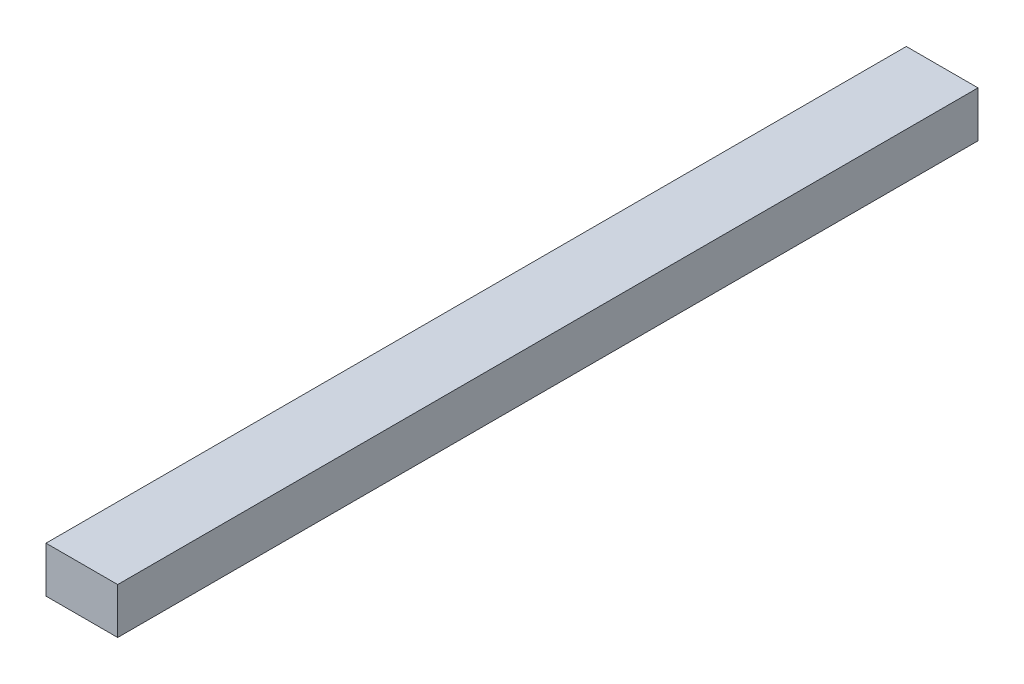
from build123d import *

# Parameters (mm, degrees)
CROQUIS1_W           = 55
CROQUIS1_H           = 35
EXTRUIR1_DEPTH       = 300
CEPILLADO_DEPTH      = 302.76563754
CEPILLADO_DEPTH_BACK = 302.76563754
CROQUIS2_W           = 55
CROQUIS2_H           = 35
CROQUIS2_W_2         = 50
CROQUIS2_H_2         = 32


with BuildPart() as part:
    # Croquis1 → Extruir1 (new, symmetric)
    with BuildSketch(Plane.XY):
        Rectangle(CROQUIS1_W, CROQUIS1_H)
    extrude(amount=EXTRUIR1_DEPTH, both=True)

    # Croquis2 → Cepillado (cut, two sides: drawn at the far end of the back side and taken through both)
    with BuildSketch(Plane.XY.offset(-CEPILLADO_DEPTH_BACK)):
        Rectangle(CROQUIS2_W, CROQUIS2_H)
        Rectangle(CROQUIS2_W_2, CROQUIS2_H_2, mode=Mode.SUBTRACT)
    extrude(amount=CEPILLADO_DEPTH + CEPILLADO_DEPTH_BACK, mode=Mode.SUBTRACT)


solid = part.part
